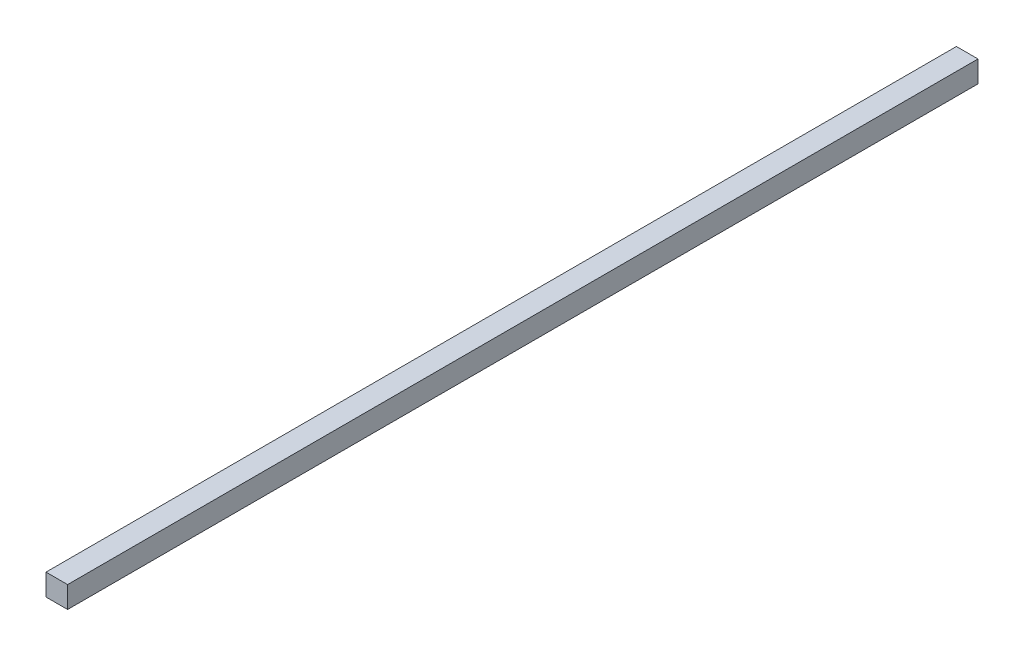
ISO-10303-21;
HEADER;
FILE_DESCRIPTION(('STEP AP214'),'2;1');
FILE_NAME('part.step','',(''),(''),'','','');
FILE_SCHEMA(('AUTOMOTIVE_DESIGN { 1 0 10303 214 1 1 1 1 }'));
ENDSEC;
DATA;
#1=APPLICATION_CONTEXT('core data for automotive mechanical design processes');
#2=APPLICATION_PROTOCOL_DEFINITION('international standard','automotive_design',2000,#1);
#3=PRODUCT_CONTEXT('',#1,'mechanical');
#4=PRODUCT('Part','Part','',(#3));
#5=PRODUCT_RELATED_PRODUCT_CATEGORY('part','',(#4));
#6=PRODUCT_DEFINITION_FORMATION('','',#4);
#7=PRODUCT_DEFINITION_CONTEXT('part definition',#1,'design');
#8=PRODUCT_DEFINITION('design','',#6,#7);
#9=PRODUCT_DEFINITION_SHAPE('','',#8);
#10=(LENGTH_UNIT() NAMED_UNIT(*) SI_UNIT(.MILLI.,.METRE.));
#11=(NAMED_UNIT(*) PLANE_ANGLE_UNIT() SI_UNIT($,.RADIAN.));
#12=(NAMED_UNIT(*) SI_UNIT($,.STERADIAN.) SOLID_ANGLE_UNIT());
#13=UNCERTAINTY_MEASURE_WITH_UNIT(LENGTH_MEASURE(1.E-05),#10,'distance_accuracy_value','');
#14=(GEOMETRIC_REPRESENTATION_CONTEXT(3) GLOBAL_UNCERTAINTY_ASSIGNED_CONTEXT((#13)) GLOBAL_UNIT_ASSIGNED_CONTEXT((#10,
#11,#12)) REPRESENTATION_CONTEXT('',''));
#15=CARTESIAN_POINT('',(0.,0.,0.));
#16=DIRECTION('',(0.,0.,1.));
#17=DIRECTION('',(1.,0.,0.));
#18=AXIS2_PLACEMENT_3D('',#15,#16,#17);
#19=CARTESIAN_POINT('',(0.,0.,267.758));
#20=DIRECTION('',(1.,0.,0.));
#21=DIRECTION('',(0.,1.,0.));
#22=AXIS2_PLACEMENT_3D('',#19,#20,#21);
#23=PLANE('',#22);
#24=DIRECTION('',(0.,-1.,0.));
#25=VECTOR('',#24,1.);
#26=CARTESIAN_POINT('',(0.,0.,0.));
#27=LINE('',#26,#25);
#28=CARTESIAN_POINT('',(0.,6.35,0.));
#29=VERTEX_POINT('',#28);
#30=CARTESIAN_POINT('',(0.,0.,0.));
#31=VERTEX_POINT('',#30);
#32=EDGE_CURVE('E97',#29,#31,#27,.T.);
#33=ORIENTED_EDGE('',*,*,#32,.T.);
#34=DIRECTION('',(0.,0.,-1.));
#35=VECTOR('',#34,1.);
#36=CARTESIAN_POINT('',(0.,0.,267.758));
#37=LINE('',#36,#35);
#38=CARTESIAN_POINT('',(0.,0.,267.758));
#39=VERTEX_POINT('',#38);
#40=EDGE_CURVE('E11',#39,#31,#37,.T.);
#41=ORIENTED_EDGE('',*,*,#40,.F.);
#42=DIRECTION('',(0.,-1.,0.));
#43=VECTOR('',#42,1.);
#44=CARTESIAN_POINT('',(0.,0.,267.758));
#45=LINE('',#44,#43);
#46=CARTESIAN_POINT('',(0.,6.35,267.758));
#47=VERTEX_POINT('',#46);
#48=EDGE_CURVE('E85',#47,#39,#45,.T.);
#49=ORIENTED_EDGE('',*,*,#48,.F.);
#50=DIRECTION('',(0.,0.,-1.));
#51=VECTOR('',#50,1.);
#52=CARTESIAN_POINT('',(0.,6.35,267.758));
#53=LINE('',#52,#51);
#54=EDGE_CURVE('E93',#47,#29,#53,.T.);
#55=ORIENTED_EDGE('',*,*,#54,.T.);
#56=EDGE_LOOP('',(#33,#41,#49,#55));
#57=FACE_BOUND('',#56,.T.);
#58=ADVANCED_FACE('F34',(#57),#23,.F.);
#59=CARTESIAN_POINT('',(0.,0.,267.758));
#60=DIRECTION('',(0.,1.,0.));
#61=DIRECTION('',(0.,0.,1.));
#62=AXIS2_PLACEMENT_3D('',#59,#60,#61);
#63=PLANE('',#62);
#64=DIRECTION('',(1.,0.,0.));
#65=VECTOR('',#64,1.);
#66=CARTESIAN_POINT('',(0.,0.,0.));
#67=LINE('',#66,#65);
#68=CARTESIAN_POINT('',(6.35,0.,0.));
#69=VERTEX_POINT('',#68);
#70=EDGE_CURVE('E89',#31,#69,#67,.T.);
#71=ORIENTED_EDGE('',*,*,#70,.T.);
#72=DIRECTION('',(0.,0.,-1.));
#73=VECTOR('',#72,1.);
#74=CARTESIAN_POINT('',(6.35,0.,267.758));
#75=LINE('',#74,#73);
#76=CARTESIAN_POINT('',(6.35,0.,267.758));
#77=VERTEX_POINT('',#76);
#78=EDGE_CURVE('E42',#77,#69,#75,.T.);
#79=ORIENTED_EDGE('',*,*,#78,.F.);
#80=DIRECTION('',(1.,0.,0.));
#81=VECTOR('',#80,1.);
#82=CARTESIAN_POINT('',(0.,0.,267.758));
#83=LINE('',#82,#81);
#84=EDGE_CURVE('E80',#39,#77,#83,.T.);
#85=ORIENTED_EDGE('',*,*,#84,.F.);
#86=ORIENTED_EDGE('',*,*,#40,.T.);
#87=EDGE_LOOP('',(#71,#79,#85,#86));
#88=FACE_BOUND('',#87,.T.);
#89=ADVANCED_FACE('F88',(#88),#63,.F.);
#90=CARTESIAN_POINT('',(6.35,0.,267.758));
#91=DIRECTION('',(-1.,0.,0.));
#92=DIRECTION('',(0.,-1.,0.));
#93=AXIS2_PLACEMENT_3D('',#90,#91,#92);
#94=PLANE('',#93);
#95=DIRECTION('',(0.,1.,0.));
#96=VECTOR('',#95,1.);
#97=CARTESIAN_POINT('',(6.35,0.,0.));
#98=LINE('',#97,#96);
#99=CARTESIAN_POINT('',(6.35,6.35,0.));
#100=VERTEX_POINT('',#99);
#101=EDGE_CURVE('E67',#69,#100,#98,.T.);
#102=ORIENTED_EDGE('',*,*,#101,.T.);
#103=DIRECTION('',(0.,0.,-1.));
#104=VECTOR('',#103,1.);
#105=CARTESIAN_POINT('',(6.35,6.35,267.758));
#106=LINE('',#105,#104);
#107=CARTESIAN_POINT('',(6.35,6.35,267.758));
#108=VERTEX_POINT('',#107);
#109=EDGE_CURVE('E90',#108,#100,#106,.T.);
#110=ORIENTED_EDGE('',*,*,#109,.F.);
#111=DIRECTION('',(0.,1.,0.));
#112=VECTOR('',#111,1.);
#113=CARTESIAN_POINT('',(6.35,0.,267.758));
#114=LINE('',#113,#112);
#115=EDGE_CURVE('E83',#77,#108,#114,.T.);
#116=ORIENTED_EDGE('',*,*,#115,.F.);
#117=ORIENTED_EDGE('',*,*,#78,.T.);
#118=EDGE_LOOP('',(#102,#110,#116,#117));
#119=FACE_BOUND('',#118,.T.);
#120=ADVANCED_FACE('F91',(#119),#94,.F.);
#121=CARTESIAN_POINT('',(0.,6.35,267.758));
#122=DIRECTION('',(0.,-1.,0.));
#123=DIRECTION('',(0.,0.,-1.));
#124=AXIS2_PLACEMENT_3D('',#121,#122,#123);
#125=PLANE('',#124);
#126=DIRECTION('',(-1.,0.,0.));
#127=VECTOR('',#126,1.);
#128=CARTESIAN_POINT('',(0.,6.35,0.));
#129=LINE('',#128,#127);
#130=EDGE_CURVE('E73',#100,#29,#129,.T.);
#131=ORIENTED_EDGE('',*,*,#130,.T.);
#132=ORIENTED_EDGE('',*,*,#54,.F.);
#133=DIRECTION('',(-1.,0.,0.));
#134=VECTOR('',#133,1.);
#135=CARTESIAN_POINT('',(0.,6.35,267.758));
#136=LINE('',#135,#134);
#137=EDGE_CURVE('E50',#108,#47,#136,.T.);
#138=ORIENTED_EDGE('',*,*,#137,.F.);
#139=ORIENTED_EDGE('',*,*,#109,.T.);
#140=EDGE_LOOP('',(#131,#132,#138,#139));
#141=FACE_BOUND('',#140,.T.);
#142=ADVANCED_FACE('F104',(#141),#125,.F.);
#143=CARTESIAN_POINT('',(0.,0.,267.758));
#144=DIRECTION('',(0.,0.,-1.));
#145=DIRECTION('',(-1.,0.,0.));
#146=AXIS2_PLACEMENT_3D('',#143,#144,#145);
#147=PLANE('',#146);
#148=ORIENTED_EDGE('',*,*,#48,.T.);
#149=ORIENTED_EDGE('',*,*,#84,.T.);
#150=ORIENTED_EDGE('',*,*,#115,.T.);
#151=ORIENTED_EDGE('',*,*,#137,.T.);
#152=EDGE_LOOP('',(#148,#149,#150,#151));
#153=FACE_BOUND('',#152,.T.);
#154=ADVANCED_FACE('F81',(#153),#147,.F.);
#155=CARTESIAN_POINT('',(0.,0.,0.));
#156=DIRECTION('',(0.,0.,-1.));
#157=DIRECTION('',(-1.,0.,0.));
#158=AXIS2_PLACEMENT_3D('',#155,#156,#157);
#159=PLANE('',#158);
#160=ORIENTED_EDGE('',*,*,#32,.F.);
#161=ORIENTED_EDGE('',*,*,#130,.F.);
#162=ORIENTED_EDGE('',*,*,#101,.F.);
#163=ORIENTED_EDGE('',*,*,#70,.F.);
#164=EDGE_LOOP('',(#160,#161,#162,#163));
#165=FACE_BOUND('',#164,.T.);
#166=ADVANCED_FACE('F107',(#165),#159,.T.);
#167=CLOSED_SHELL('',(#58,#89,#120,#142,#154,#166));
#168=MANIFOLD_SOLID_BREP('B2',#167);
#169=ADVANCED_BREP_SHAPE_REPRESENTATION('',(#18,#168),#14);
#170=SHAPE_DEFINITION_REPRESENTATION(#9,#169);
ENDSEC;
END-ISO-10303-21;
